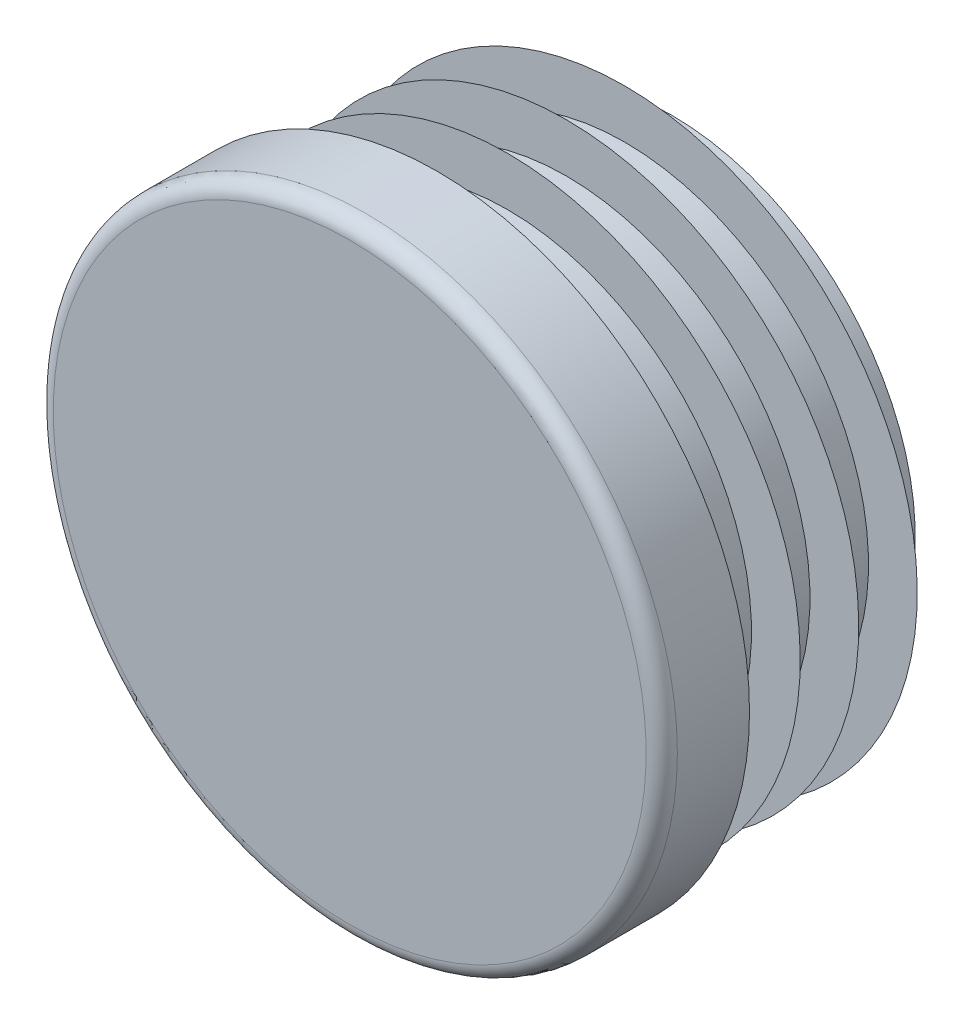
ISO-10303-21;
HEADER;
FILE_DESCRIPTION(('STEP AP214'),'2;1');
FILE_NAME('part.step','',(''),(''),'','','');
FILE_SCHEMA(('AUTOMOTIVE_DESIGN { 1 0 10303 214 1 1 1 1 }'));
ENDSEC;
DATA;
#1=APPLICATION_CONTEXT('core data for automotive mechanical design processes');
#2=APPLICATION_PROTOCOL_DEFINITION('international standard','automotive_design',2000,#1);
#3=PRODUCT_CONTEXT('',#1,'mechanical');
#4=PRODUCT('Part','Part','',(#3));
#5=PRODUCT_RELATED_PRODUCT_CATEGORY('part','',(#4));
#6=PRODUCT_DEFINITION_FORMATION('','',#4);
#7=PRODUCT_DEFINITION_CONTEXT('part definition',#1,'design');
#8=PRODUCT_DEFINITION('design','',#6,#7);
#9=PRODUCT_DEFINITION_SHAPE('','',#8);
#10=(LENGTH_UNIT() NAMED_UNIT(*) SI_UNIT(.MILLI.,.METRE.));
#11=(NAMED_UNIT(*) PLANE_ANGLE_UNIT() SI_UNIT($,.RADIAN.));
#12=(NAMED_UNIT(*) SI_UNIT($,.STERADIAN.) SOLID_ANGLE_UNIT());
#13=UNCERTAINTY_MEASURE_WITH_UNIT(LENGTH_MEASURE(1.E-05),#10,'distance_accuracy_value','');
#14=(GEOMETRIC_REPRESENTATION_CONTEXT(3) GLOBAL_UNCERTAINTY_ASSIGNED_CONTEXT((#13)) GLOBAL_UNIT_ASSIGNED_CONTEXT((#10,
#11,#12)) REPRESENTATION_CONTEXT('',''));
#15=CARTESIAN_POINT('',(0.,0.,0.));
#16=DIRECTION('',(0.,0.,1.));
#17=DIRECTION('',(1.,0.,0.));
#18=AXIS2_PLACEMENT_3D('',#15,#16,#17);
#19=CARTESIAN_POINT('',(0.,0.,4.5));
#20=DIRECTION('',(0.,0.,-1.));
#21=DIRECTION('',(0.,1.,0.));
#22=AXIS2_PLACEMENT_3D('',#19,#20,#21);
#23=PLANE('',#22);
#24=CARTESIAN_POINT('',(0.,0.,4.5));
#25=DIRECTION('',(0.,0.,-1.));
#26=DIRECTION('',(0.,1.,0.));
#27=AXIS2_PLACEMENT_3D('',#24,#25,#26);
#28=CIRCLE('',#27,15.2);
#29=CARTESIAN_POINT('',(0.,15.2,4.5));
#30=VERTEX_POINT('',#29);
#31=EDGE_CURVE('E8',#30,#30,#28,.T.);
#32=ORIENTED_EDGE('',*,*,#31,.F.);
#33=EDGE_LOOP('',(#32));
#34=FACE_BOUND('',#33,.T.);
#35=ADVANCED_FACE('F12',(#34),#23,.F.);
#36=CARTESIAN_POINT('',(0.,0.,3.7));
#37=DIRECTION('',(0.,0.,-1.));
#38=DIRECTION('',(0.,1.,0.));
#39=AXIS2_PLACEMENT_3D('',#36,#37,#38);
#40=TOROIDAL_SURFACE('',#39,15.2,0.8);
#41=ORIENTED_EDGE('',*,*,#31,.T.);
#42=EDGE_LOOP('',(#41));
#43=FACE_BOUND('',#42,.T.);
#44=CARTESIAN_POINT('',(0.,0.,3.7));
#45=DIRECTION('',(0.,0.,-1.));
#46=DIRECTION('',(0.,1.,0.));
#47=AXIS2_PLACEMENT_3D('',#44,#45,#46);
#48=CIRCLE('',#47,16.);
#49=CARTESIAN_POINT('',(0.,16.,3.7));
#50=VERTEX_POINT('',#49);
#51=EDGE_CURVE('E18',#50,#50,#48,.T.);
#52=ORIENTED_EDGE('',*,*,#51,.F.);
#53=EDGE_LOOP('',(#52));
#54=FACE_BOUND('',#53,.T.);
#55=ADVANCED_FACE('F159',(#43,#54),#40,.T.);
#56=CARTESIAN_POINT('',(0.,0.,-12.));
#57=DIRECTION('',(0.,0.,-1.));
#58=DIRECTION('',(0.,1.,0.));
#59=AXIS2_PLACEMENT_3D('',#56,#57,#58);
#60=CYLINDRICAL_SURFACE('',#59,16.);
#61=CARTESIAN_POINT('',(0.,0.,0.));
#62=DIRECTION('',(0.,0.,-1.));
#63=DIRECTION('',(0.,1.,0.));
#64=AXIS2_PLACEMENT_3D('',#61,#62,#63);
#65=CIRCLE('',#64,16.);
#66=CARTESIAN_POINT('',(0.,16.,0.));
#67=VERTEX_POINT('',#66);
#68=EDGE_CURVE('E22',#67,#67,#65,.T.);
#69=ORIENTED_EDGE('',*,*,#68,.F.);
#70=EDGE_LOOP('',(#69));
#71=FACE_BOUND('',#70,.T.);
#72=ORIENTED_EDGE('',*,*,#51,.T.);
#73=EDGE_LOOP('',(#72));
#74=FACE_BOUND('',#73,.T.);
#75=ADVANCED_FACE('F154',(#71,#74),#60,.T.);
#76=CARTESIAN_POINT('',(16.,0.,0.));
#77=DIRECTION('',(0.,0.,1.));
#78=DIRECTION('',(0.,-1.,0.));
#79=AXIS2_PLACEMENT_3D('',#76,#77,#78);
#80=PLANE('',#79);
#81=CARTESIAN_POINT('',(0.,0.,0.));
#82=DIRECTION('',(0.,0.,-1.));
#83=DIRECTION('',(0.,1.,0.));
#84=AXIS2_PLACEMENT_3D('',#81,#82,#83);
#85=CIRCLE('',#84,12.5);
#86=CARTESIAN_POINT('',(0.,12.5,0.));
#87=VERTEX_POINT('',#86);
#88=EDGE_CURVE('E26',#87,#87,#85,.T.);
#89=ORIENTED_EDGE('',*,*,#88,.F.);
#90=EDGE_LOOP('',(#89));
#91=FACE_BOUND('',#90,.T.);
#92=ORIENTED_EDGE('',*,*,#68,.T.);
#93=EDGE_LOOP('',(#92));
#94=FACE_BOUND('',#93,.T.);
#95=ADVANCED_FACE('F148',(#91,#94),#80,.F.);
#96=CARTESIAN_POINT('',(0.,0.,-12.));
#97=DIRECTION('',(0.,0.,-1.));
#98=DIRECTION('',(0.,1.,0.));
#99=AXIS2_PLACEMENT_3D('',#96,#97,#98);
#100=CYLINDRICAL_SURFACE('',#99,12.5);
#101=CARTESIAN_POINT('',(0.,0.,-0.6));
#102=DIRECTION('',(0.,0.,-1.));
#103=DIRECTION('',(0.,1.,0.));
#104=AXIS2_PLACEMENT_3D('',#101,#102,#103);
#105=CIRCLE('',#104,12.5);
#106=CARTESIAN_POINT('',(0.,12.5,-0.6));
#107=VERTEX_POINT('',#106);
#108=EDGE_CURVE('E31',#107,#107,#105,.T.);
#109=ORIENTED_EDGE('',*,*,#108,.F.);
#110=EDGE_LOOP('',(#109));
#111=FACE_BOUND('',#110,.T.);
#112=ORIENTED_EDGE('',*,*,#88,.T.);
#113=EDGE_LOOP('',(#112));
#114=FACE_BOUND('',#113,.T.);
#115=ADVANCED_FACE('F142',(#111,#114),#100,.T.);
#116=CARTESIAN_POINT('',(12.5,0.,-0.6));
#117=DIRECTION('',(0.,0.,-1.));
#118=DIRECTION('',(0.,1.,0.));
#119=AXIS2_PLACEMENT_3D('',#116,#117,#118);
#120=PLANE('',#119);
#121=CARTESIAN_POINT('',(0.,0.,-0.6));
#122=DIRECTION('',(0.,0.,-1.));
#123=DIRECTION('',(0.,1.,0.));
#124=AXIS2_PLACEMENT_3D('',#121,#122,#123);
#125=CIRCLE('',#124,15.);
#126=CARTESIAN_POINT('',(0.,15.,-0.6));
#127=VERTEX_POINT('',#126);
#128=EDGE_CURVE('E34',#127,#127,#125,.T.);
#129=ORIENTED_EDGE('',*,*,#128,.F.);
#130=EDGE_LOOP('',(#129));
#131=FACE_BOUND('',#130,.T.);
#132=ORIENTED_EDGE('',*,*,#108,.T.);
#133=EDGE_LOOP('',(#132));
#134=FACE_BOUND('',#133,.T.);
#135=ADVANCED_FACE('F136',(#131,#134),#120,.F.);
#136=CARTESIAN_POINT('',(0.,0.,-0.6));
#137=DIRECTION('',(0.,0.,1.));
#138=DIRECTION('',(0.,-1.,0.));
#139=AXIS2_PLACEMENT_3D('',#136,#137,#138);
#140=CONICAL_SURFACE('',#139,15.,0.959931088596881);
#141=CARTESIAN_POINT('',(0.,0.,-2.35051884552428));
#142=DIRECTION('',(0.,0.,-1.));
#143=DIRECTION('',(0.,1.,0.));
#144=AXIS2_PLACEMENT_3D('',#141,#142,#143);
#145=CIRCLE('',#144,12.5);
#146=CARTESIAN_POINT('',(0.,12.5,-2.35051884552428));
#147=VERTEX_POINT('',#146);
#148=EDGE_CURVE('E37',#147,#147,#145,.T.);
#149=ORIENTED_EDGE('',*,*,#148,.F.);
#150=EDGE_LOOP('',(#149));
#151=FACE_BOUND('',#150,.T.);
#152=ORIENTED_EDGE('',*,*,#128,.T.);
#153=EDGE_LOOP('',(#152));
#154=FACE_BOUND('',#153,.T.);
#155=ADVANCED_FACE('F130',(#151,#154),#140,.T.);
#156=CARTESIAN_POINT('',(0.,0.,-12.));
#157=DIRECTION('',(0.,0.,-1.));
#158=DIRECTION('',(0.,1.,0.));
#159=AXIS2_PLACEMENT_3D('',#156,#157,#158);
#160=CYLINDRICAL_SURFACE('',#159,12.5);
#161=CARTESIAN_POINT('',(0.,0.,-3.6));
#162=DIRECTION('',(0.,0.,-1.));
#163=DIRECTION('',(0.,1.,0.));
#164=AXIS2_PLACEMENT_3D('',#161,#162,#163);
#165=CIRCLE('',#164,12.5);
#166=CARTESIAN_POINT('',(0.,12.5,-3.6));
#167=VERTEX_POINT('',#166);
#168=EDGE_CURVE('E40',#167,#167,#165,.T.);
#169=ORIENTED_EDGE('',*,*,#168,.F.);
#170=EDGE_LOOP('',(#169));
#171=FACE_BOUND('',#170,.T.);
#172=ORIENTED_EDGE('',*,*,#148,.T.);
#173=EDGE_LOOP('',(#172));
#174=FACE_BOUND('',#173,.T.);
#175=ADVANCED_FACE('F124',(#171,#174),#160,.T.);
#176=CARTESIAN_POINT('',(12.5,0.,-3.6));
#177=DIRECTION('',(0.,0.,-1.));
#178=DIRECTION('',(0.,1.,0.));
#179=AXIS2_PLACEMENT_3D('',#176,#177,#178);
#180=PLANE('',#179);
#181=CARTESIAN_POINT('',(0.,0.,-3.6));
#182=DIRECTION('',(0.,0.,-1.));
#183=DIRECTION('',(0.,1.,0.));
#184=AXIS2_PLACEMENT_3D('',#181,#182,#183);
#185=CIRCLE('',#184,15.);
#186=CARTESIAN_POINT('',(0.,15.,-3.6));
#187=VERTEX_POINT('',#186);
#188=EDGE_CURVE('E43',#187,#187,#185,.T.);
#189=ORIENTED_EDGE('',*,*,#188,.F.);
#190=EDGE_LOOP('',(#189));
#191=FACE_BOUND('',#190,.T.);
#192=ORIENTED_EDGE('',*,*,#168,.T.);
#193=EDGE_LOOP('',(#192));
#194=FACE_BOUND('',#193,.T.);
#195=ADVANCED_FACE('F118',(#191,#194),#180,.F.);
#196=CARTESIAN_POINT('',(0.,0.,-3.6));
#197=DIRECTION('',(0.,0.,1.));
#198=DIRECTION('',(0.,-1.,0.));
#199=AXIS2_PLACEMENT_3D('',#196,#197,#198);
#200=CONICAL_SURFACE('',#199,15.,0.959931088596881);
#201=CARTESIAN_POINT('',(0.,0.,-5.35051884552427));
#202=DIRECTION('',(0.,0.,-1.));
#203=DIRECTION('',(0.,1.,0.));
#204=AXIS2_PLACEMENT_3D('',#201,#202,#203);
#205=CIRCLE('',#204,12.5);
#206=CARTESIAN_POINT('',(0.,12.5,-5.35051884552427));
#207=VERTEX_POINT('',#206);
#208=EDGE_CURVE('E46',#207,#207,#205,.T.);
#209=ORIENTED_EDGE('',*,*,#208,.F.);
#210=EDGE_LOOP('',(#209));
#211=FACE_BOUND('',#210,.T.);
#212=ORIENTED_EDGE('',*,*,#188,.T.);
#213=EDGE_LOOP('',(#212));
#214=FACE_BOUND('',#213,.T.);
#215=ADVANCED_FACE('F112',(#211,#214),#200,.T.);
#216=CARTESIAN_POINT('',(0.,0.,-12.));
#217=DIRECTION('',(0.,0.,-1.));
#218=DIRECTION('',(0.,1.,0.));
#219=AXIS2_PLACEMENT_3D('',#216,#217,#218);
#220=CYLINDRICAL_SURFACE('',#219,12.5);
#221=CARTESIAN_POINT('',(0.,0.,-6.6));
#222=DIRECTION('',(0.,0.,-1.));
#223=DIRECTION('',(0.,1.,0.));
#224=AXIS2_PLACEMENT_3D('',#221,#222,#223);
#225=CIRCLE('',#224,12.5);
#226=CARTESIAN_POINT('',(0.,12.5,-6.6));
#227=VERTEX_POINT('',#226);
#228=EDGE_CURVE('E49',#227,#227,#225,.T.);
#229=ORIENTED_EDGE('',*,*,#228,.F.);
#230=EDGE_LOOP('',(#229));
#231=FACE_BOUND('',#230,.T.);
#232=ORIENTED_EDGE('',*,*,#208,.T.);
#233=EDGE_LOOP('',(#232));
#234=FACE_BOUND('',#233,.T.);
#235=ADVANCED_FACE('F106',(#231,#234),#220,.T.);
#236=CARTESIAN_POINT('',(12.5,0.,-6.6));
#237=DIRECTION('',(0.,0.,-1.));
#238=DIRECTION('',(0.,1.,0.));
#239=AXIS2_PLACEMENT_3D('',#236,#237,#238);
#240=PLANE('',#239);
#241=CARTESIAN_POINT('',(0.,0.,-6.6));
#242=DIRECTION('',(0.,0.,-1.));
#243=DIRECTION('',(0.,1.,0.));
#244=AXIS2_PLACEMENT_3D('',#241,#242,#243);
#245=CIRCLE('',#244,15.);
#246=CARTESIAN_POINT('',(0.,15.,-6.6));
#247=VERTEX_POINT('',#246);
#248=EDGE_CURVE('E52',#247,#247,#245,.T.);
#249=ORIENTED_EDGE('',*,*,#248,.F.);
#250=EDGE_LOOP('',(#249));
#251=FACE_BOUND('',#250,.T.);
#252=ORIENTED_EDGE('',*,*,#228,.T.);
#253=EDGE_LOOP('',(#252));
#254=FACE_BOUND('',#253,.T.);
#255=ADVANCED_FACE('F100',(#251,#254),#240,.F.);
#256=CARTESIAN_POINT('',(0.,0.,-6.6));
#257=DIRECTION('',(0.,0.,1.));
#258=DIRECTION('',(0.,-1.,0.));
#259=AXIS2_PLACEMENT_3D('',#256,#257,#258);
#260=CONICAL_SURFACE('',#259,15.,0.959931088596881);
#261=CARTESIAN_POINT('',(0.,0.,-8.35051884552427));
#262=DIRECTION('',(0.,0.,-1.));
#263=DIRECTION('',(0.,1.,0.));
#264=AXIS2_PLACEMENT_3D('',#261,#262,#263);
#265=CIRCLE('',#264,12.5);
#266=CARTESIAN_POINT('',(0.,12.5,-8.35051884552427));
#267=VERTEX_POINT('',#266);
#268=EDGE_CURVE('E55',#267,#267,#265,.T.);
#269=ORIENTED_EDGE('',*,*,#268,.F.);
#270=EDGE_LOOP('',(#269));
#271=FACE_BOUND('',#270,.T.);
#272=ORIENTED_EDGE('',*,*,#248,.T.);
#273=EDGE_LOOP('',(#272));
#274=FACE_BOUND('',#273,.T.);
#275=ADVANCED_FACE('F94',(#271,#274),#260,.T.);
#276=CARTESIAN_POINT('',(0.,0.,-12.));
#277=DIRECTION('',(0.,0.,-1.));
#278=DIRECTION('',(0.,1.,0.));
#279=AXIS2_PLACEMENT_3D('',#276,#277,#278);
#280=CYLINDRICAL_SURFACE('',#279,12.5);
#281=CARTESIAN_POINT('',(0.,0.,-9.6));
#282=DIRECTION('',(0.,0.,-1.));
#283=DIRECTION('',(0.,1.,0.));
#284=AXIS2_PLACEMENT_3D('',#281,#282,#283);
#285=CIRCLE('',#284,12.5);
#286=CARTESIAN_POINT('',(0.,12.5,-9.6));
#287=VERTEX_POINT('',#286);
#288=EDGE_CURVE('E58',#287,#287,#285,.T.);
#289=ORIENTED_EDGE('',*,*,#288,.F.);
#290=EDGE_LOOP('',(#289));
#291=FACE_BOUND('',#290,.T.);
#292=ORIENTED_EDGE('',*,*,#268,.T.);
#293=EDGE_LOOP('',(#292));
#294=FACE_BOUND('',#293,.T.);
#295=ADVANCED_FACE('F88',(#291,#294),#280,.T.);
#296=CARTESIAN_POINT('',(12.5,0.,-9.6));
#297=DIRECTION('',(0.,0.,-1.));
#298=DIRECTION('',(0.,1.,0.));
#299=AXIS2_PLACEMENT_3D('',#296,#297,#298);
#300=PLANE('',#299);
#301=CARTESIAN_POINT('',(0.,0.,-9.6));
#302=DIRECTION('',(0.,0.,-1.));
#303=DIRECTION('',(0.,1.,0.));
#304=AXIS2_PLACEMENT_3D('',#301,#302,#303);
#305=CIRCLE('',#304,15.);
#306=CARTESIAN_POINT('',(0.,15.,-9.6));
#307=VERTEX_POINT('',#306);
#308=EDGE_CURVE('E61',#307,#307,#305,.T.);
#309=ORIENTED_EDGE('',*,*,#308,.F.);
#310=EDGE_LOOP('',(#309));
#311=FACE_BOUND('',#310,.T.);
#312=ORIENTED_EDGE('',*,*,#288,.T.);
#313=EDGE_LOOP('',(#312));
#314=FACE_BOUND('',#313,.T.);
#315=ADVANCED_FACE('F82',(#311,#314),#300,.F.);
#316=CARTESIAN_POINT('',(0.,0.,-9.6));
#317=DIRECTION('',(0.,0.,1.));
#318=DIRECTION('',(0.,-1.,0.));
#319=AXIS2_PLACEMENT_3D('',#316,#317,#318);
#320=CONICAL_SURFACE('',#319,15.,0.959931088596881);
#321=CARTESIAN_POINT('',(0.,0.,-11.3505188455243));
#322=DIRECTION('',(0.,0.,-1.));
#323=DIRECTION('',(0.,1.,0.));
#324=AXIS2_PLACEMENT_3D('',#321,#322,#323);
#325=CIRCLE('',#324,12.5);
#326=CARTESIAN_POINT('',(0.,12.5,-11.3505188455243));
#327=VERTEX_POINT('',#326);
#328=EDGE_CURVE('E64',#327,#327,#325,.T.);
#329=ORIENTED_EDGE('',*,*,#328,.F.);
#330=EDGE_LOOP('',(#329));
#331=FACE_BOUND('',#330,.T.);
#332=ORIENTED_EDGE('',*,*,#308,.T.);
#333=EDGE_LOOP('',(#332));
#334=FACE_BOUND('',#333,.T.);
#335=ADVANCED_FACE('F76',(#331,#334),#320,.T.);
#336=CARTESIAN_POINT('',(0.,0.,-12.));
#337=DIRECTION('',(0.,0.,-1.));
#338=DIRECTION('',(0.,1.,0.));
#339=AXIS2_PLACEMENT_3D('',#336,#337,#338);
#340=CYLINDRICAL_SURFACE('',#339,12.5);
#341=CARTESIAN_POINT('',(0.,0.,-12.));
#342=DIRECTION('',(0.,0.,-1.));
#343=DIRECTION('',(0.,1.,0.));
#344=AXIS2_PLACEMENT_3D('',#341,#342,#343);
#345=CIRCLE('',#344,12.5);
#346=CARTESIAN_POINT('',(0.,12.5,-12.));
#347=VERTEX_POINT('',#346);
#348=EDGE_CURVE('E67',#347,#347,#345,.T.);
#349=ORIENTED_EDGE('',*,*,#348,.F.);
#350=EDGE_LOOP('',(#349));
#351=FACE_BOUND('',#350,.T.);
#352=ORIENTED_EDGE('',*,*,#328,.T.);
#353=EDGE_LOOP('',(#352));
#354=FACE_BOUND('',#353,.T.);
#355=ADVANCED_FACE('F73',(#351,#354),#340,.T.);
#356=CARTESIAN_POINT('',(12.5,0.,-12.));
#357=DIRECTION('',(0.,0.,1.));
#358=DIRECTION('',(0.,-1.,0.));
#359=AXIS2_PLACEMENT_3D('',#356,#357,#358);
#360=PLANE('',#359);
#361=ORIENTED_EDGE('',*,*,#348,.T.);
#362=EDGE_LOOP('',(#361));
#363=FACE_BOUND('',#362,.T.);
#364=ADVANCED_FACE('F71',(#363),#360,.F.);
#365=CLOSED_SHELL('',(#35,#55,#75,#95,#115,#135,#155,#175,#195,#215,#235,#255,#275,#295,#315,
#335,#355,#364));
#366=MANIFOLD_SOLID_BREP('B1',#365);
#367=ADVANCED_BREP_SHAPE_REPRESENTATION('',(#18,#366),#14);
#368=SHAPE_DEFINITION_REPRESENTATION(#9,#367);
ENDSEC;
END-ISO-10303-21;
